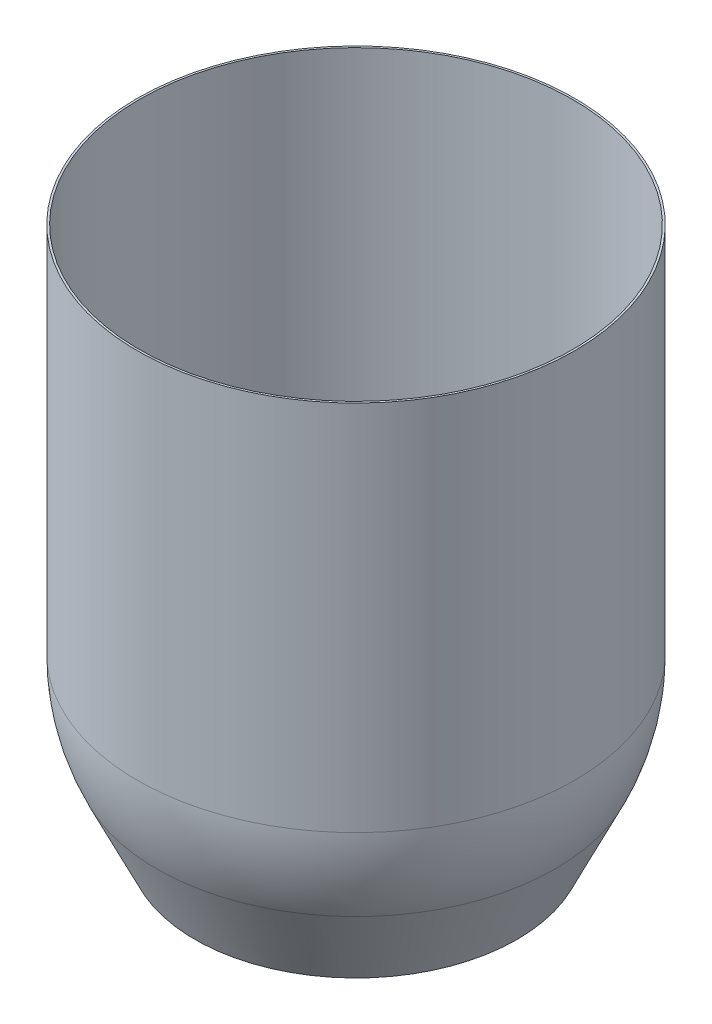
from build123d import *

# Parameters (mm, degrees)
ESQUISSE2_R             = 74
ENL_V_MAT_EXTRU_1_DEPTH = 10
CHANFREIN1_SIZE         = 0.75


with BuildPart() as part:
    # Esquisse1 → R_vol.-Mince2 (revolve)
    with BuildSketch(Plane.XY):
        with BuildLine():
            Line((-108, 57.080632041), (-108, -128.374224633))
            ThreePointArc((-108, -128.374224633), (-105.563777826, -150.257392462), (-98.374411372, -171.068957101))
            Line((-98.374411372, -171.068957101), (-79.681045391, -210.419367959))
            Line((-79.681045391, -210.419367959), (0, -210.419367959))
            Line((0, -210.419367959), (0, -211.419367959))
            Line((0, -211.419367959), (-80.313097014, -211.419367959))
            Line((-80.313097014, -211.419367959), (-99.277671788, -171.498049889))
            ThreePointArc((-99.277671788, -171.498049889), (-106.539293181, -150.477323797), (-109, -128.374224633))
            Line((-109, -128.374224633), (-109, 57.080632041))
            Line((-109, 57.080632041), (-108, 57.080632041))
        make_face()
    revolve(axis=Axis((0, 67.478104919, 0), (0, -1, 0)))

    # Esquisse2 → Enl_v. mat.-Extru.1 (cut)
    with BuildSketch(Plane.XZ.offset(211.419367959)):
        Circle(ESQUISSE2_R)
    extrude(amount=-ENL_V_MAT_EXTRU_1_DEPTH, mode=Mode.SUBTRACT)

    # Chanfrein1
    chanfrein1_edges = [part.edges().sort_by_distance(p)[0] for p in [
        (-74, -210.419367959, 0),
    ]]
    chamfer(chanfrein1_edges, length=CHANFREIN1_SIZE)


solid = part.part
